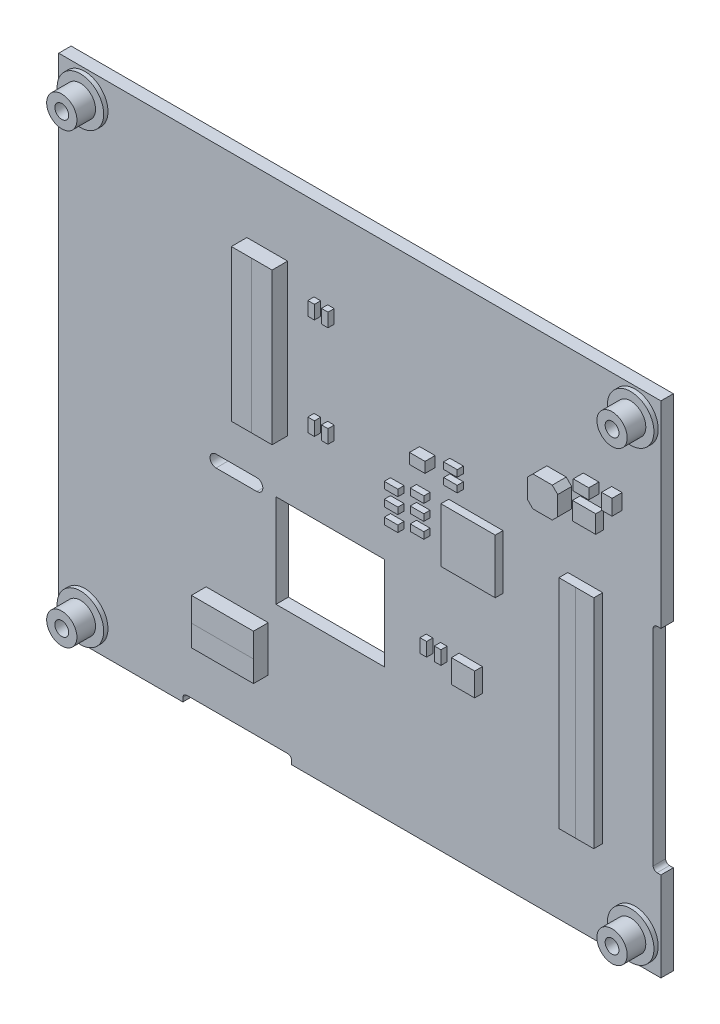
from build123d import *

# Parameters (mm, degrees)
SKETCH2_W                                 = 14
SKETCH2_H                                 = 12
PCB_DEPTH                                 = 1.6
SKETCH3_W                                 = 4.5
SKETCH3_H                                 = 28
F_50_PIN_J_LCD_DEPTH                      = 1.15
SKETCH3_3_W                               = 8
SKETCH3_3_H                               = 5.85
F_4_PIN_J_RTP_DEPTH                       = 1.9
SKETCH3_4_W                               = 5.25
SKETCH3_4_H                               = 19.5
F_30_PIN_J_HOST_DEPTH                     = 2
SKETCH5_R                                 = 3
SKETCH5_R_2                               = 1.95
BOSS_EXTRUDE5_DEPTH                       = 0.55
SKETCH5_2_R                               = 1.95
BOSS_EXTRUDE6_DEPTH                       = 2.95
F_2_56_TAPPED_HOLE2_D                     = 1.778
F_2_56_TAPPED_HOLE2_DEPTH                 = 3.5
F_2_56_TAPPED_HOLE2_TIP                   = 0.53416509
IC_SKETCH_MESSY_REF_ONLY_W                = 0.85
IC_SKETCH_MESSY_REF_ONLY_H                = 1.75
IC_SKETCH_MESSY_REF_ONLY_W_2              = 1.75
IC_SKETCH_MESSY_REF_ONLY_H_2              = 0.85
SMALL_CAPS_DEPTH                          = 0.8
IC_SKETCH_MESSY_ONLY_FOR_APPEARANCE_3_W   = 2
IC_SKETCH_MESSY_ONLY_FOR_APPEARANCE_3_H   = 1.35
IC_SKETCH_MESSY_ONLY_FOR_APPEARANCE_3_W_2 = 1.35
IC_SKETCH_MESSY_ONLY_FOR_APPEARANCE_3_H_2 = 2
BIG_CAPS_DEPTH                            = 1.3
IC_SKETCH_MESSY_ONLY_FOR_APPEARANCE_4_W   = 7
IC_SKETCH_MESSY_ONLY_FOR_APPEARANCE_4_H   = 7
IC_SKETCH_MESSY_ONLY_FOR_APPEARANCE_4_W_2 = 3
IC_SKETCH_MESSY_ONLY_FOR_APPEARANCE_4_H_2 = 3
IC_SKETCH_MESSY_ONLY_FOR_APPEARANCE_4_H_3 = 2.3
ICS_DEPTH                                 = 1
C223F_DEPTH                               = 1.8


with BuildPart() as part:
    # Sketch2 → PCB (new body)
    with BuildSketch(Plane.XY):
        with BuildLine():
            Line((38.8, 6.8), (38.3, 6.8))
            ThreePointArc((38.3, 6.8), (37.946446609, 6.653553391), (37.8, 6.3))
            Line((37.8, 6.3), (37.8, -20.2))
            ThreePointArc((37.8, -20.2), (37.946446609, -20.553553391), (38.3, -20.7))
            Line((38.3, -20.7), (38.8, -20.7))
            Line((38.8, -20.7), (38.8, -32.2))
            Line((38.8, -32.2), (-8.8, -32.2))
            Line((-8.8, -32.2), (-8.8, -31.7))
            ThreePointArc((-8.8, -31.7), (-8.946446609, -31.346446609), (-9.3, -31.2))
            Line((-9.3, -31.2), (-22.3, -31.2))
            ThreePointArc((-22.3, -31.2), (-22.653553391, -31.346446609), (-22.8, -31.7))
            Line((-22.8, -31.7), (-22.8, -32.2))
            Line((-22.8, -32.2), (-38.8, -32.2))
            Line((-38.8, -32.2), (-38.8, 32.2))
            Line((-38.8, 32.2), (38.8, 32.2))
            Line((38.8, 32.2), (38.8, 6.8))
        make_face()
        with Locations((-3.8, -9.3)):
            Rectangle(SKETCH2_W, SKETCH2_H, mode=Mode.SUBTRACT)
        with BuildLine():
            Line((-18.525, -2.4), (-13.275, -2.4))
            ThreePointArc((-13.275, -2.4), (-12.5, -3.175), (-13.275, -3.95))
            Line((-13.275, -3.95), (-18.525, -3.95))
            ThreePointArc((-18.525, -3.95), (-19.3, -3.175), (-18.525, -2.4))
        make_face(mode=Mode.SUBTRACT)
    extrude(amount=PCB_DEPTH)

    # Sketch3 → 50-Pin J_LCD (add)
    with BuildSketch(Plane.XY.offset(1.6)):
        with Locations((29.05, -6.95)):
            Rectangle(SKETCH3_W, SKETCH3_H)
    extrude(amount=F_50_PIN_J_LCD_DEPTH)

    # Sketch3_3 → 4-Pin J-RTP (add)
    with BuildSketch(Plane.XY.offset(1.6)):
        with Locations((-15.8, -20.775)):
            Rectangle(SKETCH3_3_W, SKETCH3_3_H)
    extrude(amount=F_4_PIN_J_RTP_DEPTH)

    # Sketch3_4 → 30-Pin J-HOST (add)
    with BuildSketch(Plane.XY.offset(1.6)):
        with Locations((-11.925, 14)):
            Rectangle(SKETCH3_4_W, SKETCH3_4_H)
    extrude(amount=F_30_PIN_J_HOST_DEPTH)

    # Sketch5 → Boss-Extrude5 (add)
    # profile 1 of 4: a face of its own
    with BuildSketch(Plane.XY.offset(1.6)):
        with Locations((-35.45, 28.85)):
            Circle(SKETCH5_R)
        with Locations((-35.45, 28.85)):
            Circle(SKETCH5_R_2, mode=Mode.SUBTRACT)
    # profile 2 of 4: a face of its own
    with BuildSketch(Plane.XY.offset(1.6)):
        with Locations(Location((35.45, 28.85, 0), (0, 0, 180))):
            Circle(SKETCH5_R)
        with Locations(Location((35.45, 28.85, 0), (0, 0, 180))):
            Circle(SKETCH5_R_2, mode=Mode.SUBTRACT)
    # profile 3 of 4: a face of its own
    with BuildSketch(Plane.XY.offset(1.6)):
        with Locations((35.45, -28.85)):
            Circle(SKETCH5_R)
        with Locations((35.45, -28.85)):
            Circle(SKETCH5_R_2, mode=Mode.SUBTRACT)
    # profile 4 of 4: a face of its own
    with BuildSketch(Plane.XY.offset(1.6)):
        with Locations(Location((-35.45, -28.85, 0), (0, 0, 180))):
            Circle(SKETCH5_R)
        with Locations(Location((-35.45, -28.85, 0), (0, 0, 180))):
            Circle(SKETCH5_R_2, mode=Mode.SUBTRACT)
    extrude(amount=BOSS_EXTRUDE5_DEPTH)

    # Sketch5_2 → Boss-Extrude6 (add)
    with BuildSketch(Plane.XY.offset(1.6)):
        with Locations((-35.45, 28.85)):
            Circle(SKETCH5_2_R)
        with Locations(Location((35.45, 28.85, 0), (0, 0, 180))):
            Circle(SKETCH5_2_R)
        with Locations((35.45, -28.85)):
            Circle(SKETCH5_2_R)
        with Locations(Location((-35.45, -28.85, 0), (0, 0, 180))):
            Circle(SKETCH5_2_R)
    extrude(amount=BOSS_EXTRUDE6_DEPTH)

    # 2-56 Tapped Hole2
    with Locations(Plane(origin=(-35.45, 28.85, 4.55), x_dir=(1, 0, 0), z_dir=(0, 0, 1))):
        with Locations((0, 0), (70.9, -57.7), (0, -57.7), (70.9, 0)):
            Hole(F_2_56_TAPPED_HOLE2_D / 2, depth=F_2_56_TAPPED_HOLE2_DEPTH)
            with Locations((0, 0, -(F_2_56_TAPPED_HOLE2_DEPTH + F_2_56_TAPPED_HOLE2_TIP / 2))):  # 118° drill point
                Cone(0, F_2_56_TAPPED_HOLE2_D / 2, F_2_56_TAPPED_HOLE2_TIP, mode=Mode.SUBTRACT)

    # IC Sketch. Messy. REF Only → Small Caps (add)
    with BuildSketch(Plane.XY.offset(1.6)):
        with Locations((-5.475, 20.575)):
            Rectangle(IC_SKETCH_MESSY_REF_ONLY_W, IC_SKETCH_MESSY_REF_ONLY_H)
        with Locations((4.825, 5.775)):
            Rectangle(IC_SKETCH_MESSY_REF_ONLY_W_2, IC_SKETCH_MESSY_REF_ONLY_H_2)
        with Locations((8.175, 6.7)):
            Rectangle(IC_SKETCH_MESSY_REF_ONLY_W_2, IC_SKETCH_MESSY_REF_ONLY_H_2)
        with Locations((4.825, 1.775)):
            Rectangle(IC_SKETCH_MESSY_REF_ONLY_W_2, IC_SKETCH_MESSY_REF_ONLY_H_2)
        with Locations((8.175, 2.7)):
            Rectangle(IC_SKETCH_MESSY_REF_ONLY_W_2, IC_SKETCH_MESSY_REF_ONLY_H_2)
        with Locations((12.475, 10.025)):
            Rectangle(IC_SKETCH_MESSY_REF_ONLY_W_2, IC_SKETCH_MESSY_REF_ONLY_H_2)
        with Locations((12.475, 11.775)):
            Rectangle(IC_SKETCH_MESSY_REF_ONLY_W_2, IC_SKETCH_MESSY_REF_ONLY_H_2)
        with Locations((-3.725, 20.575)):
            Rectangle(IC_SKETCH_MESSY_REF_ONLY_W, IC_SKETCH_MESSY_REF_ONLY_H)
        with Locations((-5.475, 7.575)):
            Rectangle(IC_SKETCH_MESSY_REF_ONLY_W, IC_SKETCH_MESSY_REF_ONLY_H)
        with Locations((-3.725, 7.575)):
            Rectangle(IC_SKETCH_MESSY_REF_ONLY_W, IC_SKETCH_MESSY_REF_ONLY_H)
        with Locations((8.175, 4.7)):
            Rectangle(IC_SKETCH_MESSY_REF_ONLY_W_2, IC_SKETCH_MESSY_REF_ONLY_H_2)
        with Locations((4.825, 3.775)):
            Rectangle(IC_SKETCH_MESSY_REF_ONLY_W_2, IC_SKETCH_MESSY_REF_ONLY_H_2)
        with Locations((8.975, -9.825)):
            Rectangle(IC_SKETCH_MESSY_REF_ONLY_W, IC_SKETCH_MESSY_REF_ONLY_H)
        with Locations((10.825, -9.825)):
            Rectangle(IC_SKETCH_MESSY_REF_ONLY_W, IC_SKETCH_MESSY_REF_ONLY_H)
    extrude(amount=SMALL_CAPS_DEPTH)

    # IC Sketch. Messy. Only for appearance_3 → Big Caps (add)
    with BuildSketch(Plane.XY.offset(1.6)):
        with Locations((8.7, 10.875)):
            Rectangle(IC_SKETCH_MESSY_ONLY_FOR_APPEARANCE_3_W, IC_SKETCH_MESSY_ONLY_FOR_APPEARANCE_3_H)
        with Locations((29.8, 18.475)):
            Rectangle(IC_SKETCH_MESSY_ONLY_FOR_APPEARANCE_3_W, IC_SKETCH_MESSY_ONLY_FOR_APPEARANCE_3_H)
        with Locations((33.125, 18.475)):
            Rectangle(IC_SKETCH_MESSY_ONLY_FOR_APPEARANCE_3_W_2, IC_SKETCH_MESSY_ONLY_FOR_APPEARANCE_3_H_2)
    extrude(amount=BIG_CAPS_DEPTH)

    # IC Sketch. Messy. Only for appearance_4 → ICs (add)
    with BuildSketch(Plane.XY.offset(1.6)):
        with Locations((14.95, 4.05)):
            Rectangle(IC_SKETCH_MESSY_ONLY_FOR_APPEARANCE_4_W, IC_SKETCH_MESSY_ONLY_FOR_APPEARANCE_4_H)
        with Locations((14.3, -10.45)):
            Rectangle(IC_SKETCH_MESSY_ONLY_FOR_APPEARANCE_4_W_2, IC_SKETCH_MESSY_ONLY_FOR_APPEARANCE_4_H_2)
        with Locations((29.9, 15.25)):
            Rectangle(IC_SKETCH_MESSY_ONLY_FOR_APPEARANCE_4_W_2, IC_SKETCH_MESSY_ONLY_FOR_APPEARANCE_4_H_3)
    extrude(amount=ICS_DEPTH)

    # IC Sketch. Messy. Only for appearance_5 → C223F (add)
    with BuildSketch(Plane.XY.offset(1.6)):
        Polygon((27.3, 16.9), (27.3, 14.4), (26.6, 13.7), (24.1, 13.7), (23.4, 14.4), (23.4, 16.9), (24.1, 17.6), (26.6, 17.6), align=None)
    extrude(amount=C223F_DEPTH)


solid = part.part
